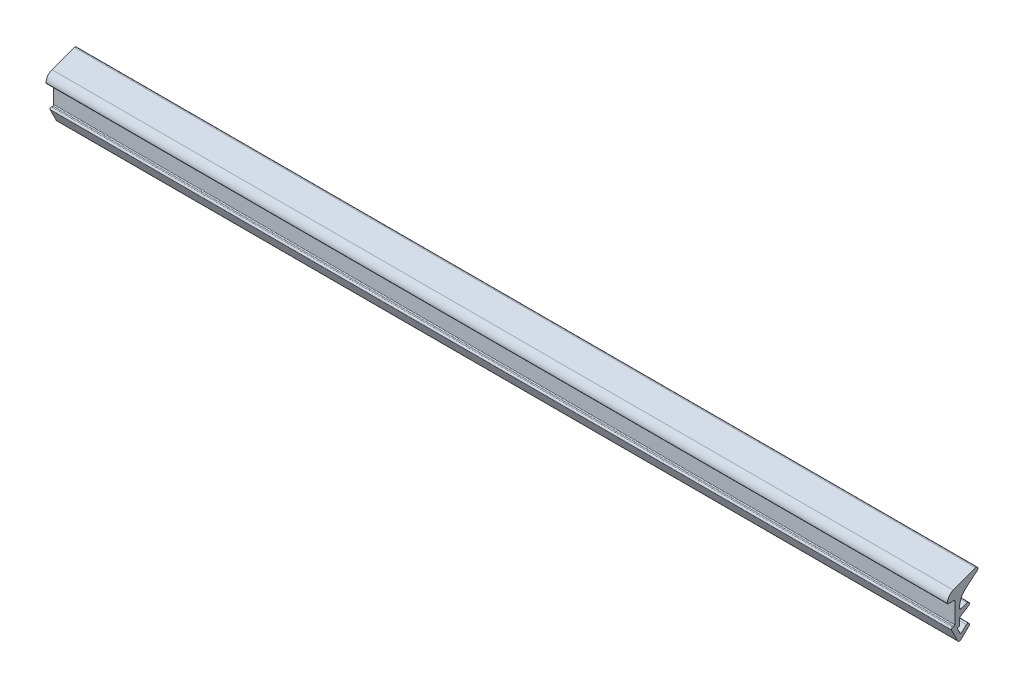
ISO-10303-21;
HEADER;
FILE_DESCRIPTION(('STEP AP214'),'2;1');
FILE_NAME('part.step','',(''),(''),'','','');
FILE_SCHEMA(('AUTOMOTIVE_DESIGN { 1 0 10303 214 1 1 1 1 }'));
ENDSEC;
DATA;
#1=APPLICATION_CONTEXT('core data for automotive mechanical design processes');
#2=APPLICATION_PROTOCOL_DEFINITION('international standard','automotive_design',2000,#1);
#3=PRODUCT_CONTEXT('',#1,'mechanical');
#4=PRODUCT('Part','Part','',(#3));
#5=PRODUCT_RELATED_PRODUCT_CATEGORY('part','',(#4));
#6=PRODUCT_DEFINITION_FORMATION('','',#4);
#7=PRODUCT_DEFINITION_CONTEXT('part definition',#1,'design');
#8=PRODUCT_DEFINITION('design','',#6,#7);
#9=PRODUCT_DEFINITION_SHAPE('','',#8);
#10=(LENGTH_UNIT() NAMED_UNIT(*) SI_UNIT(.MILLI.,.METRE.));
#11=(NAMED_UNIT(*) PLANE_ANGLE_UNIT() SI_UNIT($,.RADIAN.));
#12=(NAMED_UNIT(*) SI_UNIT($,.STERADIAN.) SOLID_ANGLE_UNIT());
#13=UNCERTAINTY_MEASURE_WITH_UNIT(LENGTH_MEASURE(1.E-05),#10,'distance_accuracy_value','');
#14=(GEOMETRIC_REPRESENTATION_CONTEXT(3) GLOBAL_UNCERTAINTY_ASSIGNED_CONTEXT((#13)) GLOBAL_UNIT_ASSIGNED_CONTEXT((#10,
#11,#12)) REPRESENTATION_CONTEXT('',''));
#15=CARTESIAN_POINT('',(0.,0.,0.));
#16=DIRECTION('',(0.,0.,1.));
#17=DIRECTION('',(1.,0.,0.));
#18=AXIS2_PLACEMENT_3D('',#15,#16,#17);
#19=CARTESIAN_POINT('',(200.,0.69634473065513,-4.15955987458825));
#20=DIRECTION('',(-1.,0.,0.));
#21=DIRECTION('',(0.,0.,1.));
#22=AXIS2_PLACEMENT_3D('',#19,#20,#21);
#23=CYLINDRICAL_SURFACE('',#22,3.99999999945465);
#24=CARTESIAN_POINT('',(0.,0.69634473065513,-4.15955987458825));
#25=DIRECTION('',(-1.,0.,0.));
#26=DIRECTION('',(0.,0.,-1.));
#27=AXIS2_PLACEMENT_3D('',#24,#25,#26);
#28=CIRCLE('',#27,3.99999999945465);
#29=CARTESIAN_POINT('',(0.,0.69634473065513,-0.159559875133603));
#30=VERTEX_POINT('',#29);
#31=CARTESIAN_POINT('',(0.,3.76052250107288,-1.58840943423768));
#32=VERTEX_POINT('',#31);
#33=EDGE_CURVE('E363',#30,#32,#28,.T.);
#34=ORIENTED_EDGE('',*,*,#33,.T.);
#35=DIRECTION('',(-1.,0.,0.));
#36=VECTOR('',#35,1.);
#37=CARTESIAN_POINT('',(200.,3.76052250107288,-1.58840943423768));
#38=LINE('',#37,#36);
#39=CARTESIAN_POINT('',(200.,3.76052250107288,-1.58840943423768));
#40=VERTEX_POINT('',#39);
#41=EDGE_CURVE('E12',#40,#32,#38,.T.);
#42=ORIENTED_EDGE('',*,*,#41,.F.);
#43=CARTESIAN_POINT('',(200.,0.69634473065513,-4.15955987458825));
#44=DIRECTION('',(-1.,0.,0.));
#45=DIRECTION('',(0.,0.,-1.));
#46=AXIS2_PLACEMENT_3D('',#43,#44,#45);
#47=CIRCLE('',#46,3.99999999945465);
#48=CARTESIAN_POINT('',(200.,0.69634473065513,-0.159559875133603));
#49=VERTEX_POINT('',#48);
#50=EDGE_CURVE('E448',#49,#40,#47,.T.);
#51=ORIENTED_EDGE('',*,*,#50,.F.);
#52=DIRECTION('',(-1.,0.,0.));
#53=VECTOR('',#52,1.);
#54=CARTESIAN_POINT('',(200.,0.69634473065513,-0.159559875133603));
#55=LINE('',#54,#53);
#56=EDGE_CURVE('E359',#49,#30,#55,.T.);
#57=ORIENTED_EDGE('',*,*,#56,.T.);
#58=EDGE_LOOP('',(#34,#42,#51,#57));
#59=FACE_BOUND('',#58,.T.);
#60=ADVANCED_FACE('F136',(#59),#23,.F.);
#61=CARTESIAN_POINT('',(200.,3.76052250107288,-1.58840943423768));
#62=DIRECTION('',(0.,0.766044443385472,0.642787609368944));
#63=DIRECTION('',(0.,-0.642787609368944,0.766044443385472));
#64=AXIS2_PLACEMENT_3D('',#61,#62,#63);
#65=PLANE('',#64);
#66=DIRECTION('',(0.,0.642787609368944,-0.766044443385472));
#67=VECTOR('',#66,1.);
#68=CARTESIAN_POINT('',(0.,3.76052250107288,-1.58840943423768));
#69=LINE('',#68,#67);
#70=CARTESIAN_POINT('',(0.,5.8819891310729,-4.11667491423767));
#71=VERTEX_POINT('',#70);
#72=EDGE_CURVE('E367',#32,#71,#69,.T.);
#73=ORIENTED_EDGE('',*,*,#72,.T.);
#74=DIRECTION('',(-1.,0.,0.));
#75=VECTOR('',#74,1.);
#76=CARTESIAN_POINT('',(200.,5.8819891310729,-4.11667491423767));
#77=LINE('',#76,#75);
#78=CARTESIAN_POINT('',(200.,5.8819891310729,-4.11667491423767));
#79=VERTEX_POINT('',#78);
#80=EDGE_CURVE('E145',#79,#71,#77,.T.);
#81=ORIENTED_EDGE('',*,*,#80,.F.);
#82=DIRECTION('',(0.,0.642787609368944,-0.766044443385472));
#83=VECTOR('',#82,1.);
#84=CARTESIAN_POINT('',(200.,3.76052250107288,-1.58840943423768));
#85=LINE('',#84,#83);
#86=EDGE_CURVE('E259',#40,#79,#85,.T.);
#87=ORIENTED_EDGE('',*,*,#86,.F.);
#88=ORIENTED_EDGE('',*,*,#41,.T.);
#89=EDGE_LOOP('',(#73,#81,#87,#88));
#90=FACE_BOUND('',#89,.T.);
#91=ADVANCED_FACE('F661',(#90),#65,.F.);
#92=CARTESIAN_POINT('',(200.,6.18840691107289,-3.85955987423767));
#93=DIRECTION('',(-1.,0.,0.));
#94=DIRECTION('',(0.,0.,1.));
#95=AXIS2_PLACEMENT_3D('',#92,#93,#94);
#96=CYLINDRICAL_SURFACE('',#95,0.399999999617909);
#97=CARTESIAN_POINT('',(0.,6.18840691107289,-3.85955987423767));
#98=DIRECTION('',(1.,0.,0.));
#99=DIRECTION('',(0.,0.,-1.));
#100=AXIS2_PLACEMENT_3D('',#97,#98,#99);
#101=CIRCLE('',#100,0.399999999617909);
#102=CARTESIAN_POINT('',(0.,6.56428395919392,-3.72275181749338));
#103=VERTEX_POINT('',#102);
#104=EDGE_CURVE('E370',#71,#103,#101,.T.);
#105=ORIENTED_EDGE('',*,*,#104,.T.);
#106=DIRECTION('',(-1.,0.,0.));
#107=VECTOR('',#106,1.);
#108=CARTESIAN_POINT('',(200.,6.56428395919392,-3.72275181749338));
#109=LINE('',#108,#107);
#110=CARTESIAN_POINT('',(200.,6.56428395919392,-3.72275181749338));
#111=VERTEX_POINT('',#110);
#112=EDGE_CURVE('E543',#111,#103,#109,.T.);
#113=ORIENTED_EDGE('',*,*,#112,.F.);
#114=CARTESIAN_POINT('',(200.,6.18840691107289,-3.85955987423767));
#115=DIRECTION('',(1.,0.,0.));
#116=DIRECTION('',(0.,0.,-1.));
#117=AXIS2_PLACEMENT_3D('',#114,#115,#116);
#118=CIRCLE('',#117,0.399999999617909);
#119=EDGE_CURVE('E553',#79,#111,#118,.T.);
#120=ORIENTED_EDGE('',*,*,#119,.F.);
#121=ORIENTED_EDGE('',*,*,#80,.T.);
#122=EDGE_LOOP('',(#105,#113,#120,#121));
#123=FACE_BOUND('',#122,.T.);
#124=ADVANCED_FACE('F551',(#123),#96,.T.);
#125=CARTESIAN_POINT('',(200.,6.56428395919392,-3.72275181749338));
#126=DIRECTION('',(0.,-0.93969262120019,-0.342020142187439));
#127=DIRECTION('',(0.,0.342020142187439,-0.93969262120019));
#128=AXIS2_PLACEMENT_3D('',#125,#126,#127);
#129=PLANE('',#128);
#130=DIRECTION('',(0.,-0.342020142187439,0.93969262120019));
#131=VECTOR('',#130,1.);
#132=CARTESIAN_POINT('',(0.,6.56428395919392,-3.72275181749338));
#133=LINE('',#132,#131);
#134=CARTESIAN_POINT('',(0.,4.76363869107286,1.22448041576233));
#135=VERTEX_POINT('',#134);
#136=EDGE_CURVE('E373',#103,#135,#133,.T.);
#137=ORIENTED_EDGE('',*,*,#136,.T.);
#138=DIRECTION('',(-1.,0.,0.));
#139=VECTOR('',#138,1.);
#140=CARTESIAN_POINT('',(200.,4.76363869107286,1.22448041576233));
#141=LINE('',#140,#139);
#142=CARTESIAN_POINT('',(200.,4.76363869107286,1.22448041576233));
#143=VERTEX_POINT('',#142);
#144=EDGE_CURVE('E539',#143,#135,#141,.T.);
#145=ORIENTED_EDGE('',*,*,#144,.F.);
#146=DIRECTION('',(0.,-0.342020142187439,0.93969262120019));
#147=VECTOR('',#146,1.);
#148=CARTESIAN_POINT('',(200.,6.56428395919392,-3.72275181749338));
#149=LINE('',#148,#147);
#150=EDGE_CURVE('E572',#111,#143,#149,.T.);
#151=ORIENTED_EDGE('',*,*,#150,.F.);
#152=ORIENTED_EDGE('',*,*,#112,.T.);
#153=EDGE_LOOP('',(#137,#145,#151,#152));
#154=FACE_BOUND('',#153,.T.);
#155=ADVANCED_FACE('F562',(#154),#129,.F.);
#156=CARTESIAN_POINT('',(200.,2.88425345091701,0.540440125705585));
#157=DIRECTION('',(-1.,0.,0.));
#158=DIRECTION('',(0.,0.,1.));
#159=AXIS2_PLACEMENT_3D('',#156,#157,#158);
#160=CYLINDRICAL_SURFACE('',#159,1.99999999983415);
#161=CARTESIAN_POINT('',(0.,2.88425345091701,0.540440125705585));
#162=DIRECTION('',(1.,0.,0.));
#163=DIRECTION('',(0.,0.,-1.));
#164=AXIS2_PLACEMENT_3D('',#161,#162,#163);
#165=CIRCLE('',#164,1.99999999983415);
#166=CARTESIAN_POINT('',(0.,2.88425345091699,2.54044012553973));
#167=VERTEX_POINT('',#166);
#168=EDGE_CURVE('E376',#135,#167,#165,.T.);
#169=ORIENTED_EDGE('',*,*,#168,.T.);
#170=DIRECTION('',(-1.,0.,0.));
#171=VECTOR('',#170,1.);
#172=CARTESIAN_POINT('',(200.,2.88425345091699,2.54044012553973));
#173=LINE('',#172,#171);
#174=CARTESIAN_POINT('',(200.,2.88425345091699,2.54044012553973));
#175=VERTEX_POINT('',#174);
#176=EDGE_CURVE('E535',#175,#167,#173,.T.);
#177=ORIENTED_EDGE('',*,*,#176,.F.);
#178=CARTESIAN_POINT('',(200.,2.88425345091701,0.540440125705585));
#179=DIRECTION('',(1.,0.,0.));
#180=DIRECTION('',(0.,0.,-1.));
#181=AXIS2_PLACEMENT_3D('',#178,#179,#180);
#182=CIRCLE('',#181,1.99999999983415);
#183=EDGE_CURVE('E568',#143,#175,#182,.T.);
#184=ORIENTED_EDGE('',*,*,#183,.F.);
#185=ORIENTED_EDGE('',*,*,#144,.T.);
#186=EDGE_LOOP('',(#169,#177,#184,#185));
#187=FACE_BOUND('',#186,.T.);
#188=ADVANCED_FACE('F566',(#187),#160,.T.);
#189=CARTESIAN_POINT('',(200.,2.88425344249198,2.34459359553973));
#190=DIRECTION('',(-1.,0.,0.));
#191=DIRECTION('',(0.,0.,1.));
#192=AXIS2_PLACEMENT_3D('',#189,#190,#191);
#193=CYLINDRICAL_SURFACE('',#192,0.195846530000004);
#194=CARTESIAN_POINT('',(0.,2.88425344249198,2.34459359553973));
#195=DIRECTION('',(1.,0.,0.));
#196=DIRECTION('',(0.,0.,-1.));
#197=AXIS2_PLACEMENT_3D('',#194,#195,#196);
#198=CIRCLE('',#197,0.195846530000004);
#199=CARTESIAN_POINT('',(0.,2.68840691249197,2.34459359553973));
#200=VERTEX_POINT('',#199);
#201=EDGE_CURVE('E379',#167,#200,#198,.T.);
#202=ORIENTED_EDGE('',*,*,#201,.T.);
#203=DIRECTION('',(-1.,0.,0.));
#204=VECTOR('',#203,1.);
#205=CARTESIAN_POINT('',(200.,2.68840691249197,2.34459359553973));
#206=LINE('',#205,#204);
#207=CARTESIAN_POINT('',(200.,2.68840691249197,2.34459359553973));
#208=VERTEX_POINT('',#207);
#209=EDGE_CURVE('E531',#208,#200,#206,.T.);
#210=ORIENTED_EDGE('',*,*,#209,.F.);
#211=CARTESIAN_POINT('',(200.,2.88425344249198,2.34459359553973));
#212=DIRECTION('',(1.,0.,0.));
#213=DIRECTION('',(0.,0.,-1.));
#214=AXIS2_PLACEMENT_3D('',#211,#212,#213);
#215=CIRCLE('',#214,0.195846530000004);
#216=EDGE_CURVE('E571',#175,#208,#215,.T.);
#217=ORIENTED_EDGE('',*,*,#216,.F.);
#218=ORIENTED_EDGE('',*,*,#176,.T.);
#219=EDGE_LOOP('',(#202,#210,#217,#218));
#220=FACE_BOUND('',#219,.T.);
#221=ADVANCED_FACE('F674',(#220),#193,.T.);
#222=CARTESIAN_POINT('',(200.,2.68840691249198,2.34459359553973));
#223=DIRECTION('',(0.,1.,0.));
#224=DIRECTION('',(0.,0.,1.));
#225=AXIS2_PLACEMENT_3D('',#222,#223,#224);
#226=PLANE('',#225);
#227=DIRECTION('',(0.,0.,-1.));
#228=VECTOR('',#227,1.);
#229=CARTESIAN_POINT('',(0.,2.68840691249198,2.34459359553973));
#230=LINE('',#229,#228);
#231=CARTESIAN_POINT('',(0.,2.68840691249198,1.04044013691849));
#232=VERTEX_POINT('',#231);
#233=EDGE_CURVE('E382',#200,#232,#230,.T.);
#234=ORIENTED_EDGE('',*,*,#233,.T.);
#235=DIRECTION('',(-1.,0.,0.));
#236=VECTOR('',#235,1.);
#237=CARTESIAN_POINT('',(200.,2.68840691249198,1.04044013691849));
#238=LINE('',#237,#236);
#239=CARTESIAN_POINT('',(200.,2.68840691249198,1.04044013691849));
#240=VERTEX_POINT('',#239);
#241=EDGE_CURVE('E527',#240,#232,#238,.T.);
#242=ORIENTED_EDGE('',*,*,#241,.F.);
#243=DIRECTION('',(0.,0.,-1.));
#244=VECTOR('',#243,1.);
#245=CARTESIAN_POINT('',(200.,2.68840691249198,2.34459359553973));
#246=LINE('',#245,#244);
#247=EDGE_CURVE('E576',#208,#240,#246,.T.);
#248=ORIENTED_EDGE('',*,*,#247,.F.);
#249=ORIENTED_EDGE('',*,*,#209,.T.);
#250=EDGE_LOOP('',(#234,#242,#248,#249));
#251=FACE_BOUND('',#250,.T.);
#252=ADVANCED_FACE('F677',(#251),#226,.F.);
#253=CARTESIAN_POINT('',(200.,2.48840691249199,1.04044013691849));
#254=DIRECTION('',(-1.,0.,0.));
#255=DIRECTION('',(0.,0.,1.));
#256=AXIS2_PLACEMENT_3D('',#253,#254,#255);
#257=CYLINDRICAL_SURFACE('',#256,0.199999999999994);
#258=CARTESIAN_POINT('',(0.,2.48840691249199,1.04044013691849));
#259=DIRECTION('',(-1.,0.,0.));
#260=DIRECTION('',(0.,0.,-1.));
#261=AXIS2_PLACEMENT_3D('',#258,#259,#260);
#262=CIRCLE('',#261,0.199999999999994);
#263=CARTESIAN_POINT('',(0.,2.48840691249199,0.840440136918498));
#264=VERTEX_POINT('',#263);
#265=EDGE_CURVE('E385',#232,#264,#262,.T.);
#266=ORIENTED_EDGE('',*,*,#265,.T.);
#267=DIRECTION('',(-1.,0.,0.));
#268=VECTOR('',#267,1.);
#269=CARTESIAN_POINT('',(200.,2.48840691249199,0.840440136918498));
#270=LINE('',#269,#268);
#271=CARTESIAN_POINT('',(200.,2.48840691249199,0.840440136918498));
#272=VERTEX_POINT('',#271);
#273=EDGE_CURVE('E523',#272,#264,#270,.T.);
#274=ORIENTED_EDGE('',*,*,#273,.F.);
#275=CARTESIAN_POINT('',(200.,2.48840691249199,1.04044013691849));
#276=DIRECTION('',(-1.,0.,0.));
#277=DIRECTION('',(0.,0.,-1.));
#278=AXIS2_PLACEMENT_3D('',#275,#276,#277);
#279=CIRCLE('',#278,0.199999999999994);
#280=EDGE_CURVE('E583',#240,#272,#279,.T.);
#281=ORIENTED_EDGE('',*,*,#280,.F.);
#282=ORIENTED_EDGE('',*,*,#241,.T.);
#283=EDGE_LOOP('',(#266,#274,#281,#282));
#284=FACE_BOUND('',#283,.T.);
#285=ADVANCED_FACE('F681',(#284),#257,.F.);
#286=CARTESIAN_POINT('',(200.,2.48840691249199,0.84044013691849));
#287=DIRECTION('',(0.,0.,-1.));
#288=DIRECTION('',(-1.,0.,0.));
#289=AXIS2_PLACEMENT_3D('',#286,#287,#288);
#290=PLANE('',#289);
#291=DIRECTION('',(0.,-1.,0.));
#292=VECTOR('',#291,1.);
#293=CARTESIAN_POINT('',(0.,2.48840691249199,0.84044013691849));
#294=LINE('',#293,#292);
#295=CARTESIAN_POINT('',(0.,-2.11159308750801,0.84044013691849));
#296=VERTEX_POINT('',#295);
#297=EDGE_CURVE('E388',#264,#296,#294,.T.);
#298=ORIENTED_EDGE('',*,*,#297,.T.);
#299=DIRECTION('',(-1.,0.,0.));
#300=VECTOR('',#299,1.);
#301=CARTESIAN_POINT('',(200.,-2.11159308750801,0.84044013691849));
#302=LINE('',#301,#300);
#303=CARTESIAN_POINT('',(200.,-2.11159308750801,0.84044013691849));
#304=VERTEX_POINT('',#303);
#305=EDGE_CURVE('E519',#304,#296,#302,.T.);
#306=ORIENTED_EDGE('',*,*,#305,.F.);
#307=DIRECTION('',(0.,-1.,0.));
#308=VECTOR('',#307,1.);
#309=CARTESIAN_POINT('',(200.,2.48840691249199,0.84044013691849));
#310=LINE('',#309,#308);
#311=EDGE_CURVE('E586',#272,#304,#310,.T.);
#312=ORIENTED_EDGE('',*,*,#311,.F.);
#313=ORIENTED_EDGE('',*,*,#273,.T.);
#314=EDGE_LOOP('',(#298,#306,#312,#313));
#315=FACE_BOUND('',#314,.T.);
#316=ADVANCED_FACE('F685',(#315),#290,.F.);
#317=CARTESIAN_POINT('',(200.,-2.11159308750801,1.04044013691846));
#318=DIRECTION('',(-1.,0.,0.));
#319=DIRECTION('',(0.,0.,1.));
#320=AXIS2_PLACEMENT_3D('',#317,#318,#319);
#321=CYLINDRICAL_SURFACE('',#320,0.199999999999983);
#322=CARTESIAN_POINT('',(0.,-2.11159308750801,1.04044013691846));
#323=DIRECTION('',(-1.,0.,0.));
#324=DIRECTION('',(0.,0.,-1.));
#325=AXIS2_PLACEMENT_3D('',#322,#323,#324);
#326=CIRCLE('',#325,0.199999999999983);
#327=CARTESIAN_POINT('',(0.,-2.311593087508,1.04044013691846));
#328=VERTEX_POINT('',#327);
#329=EDGE_CURVE('E391',#296,#328,#326,.T.);
#330=ORIENTED_EDGE('',*,*,#329,.T.);
#331=DIRECTION('',(-1.,0.,0.));
#332=VECTOR('',#331,1.);
#333=CARTESIAN_POINT('',(200.,-2.311593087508,1.04044013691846));
#334=LINE('',#333,#332);
#335=CARTESIAN_POINT('',(200.,-2.311593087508,1.04044013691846));
#336=VERTEX_POINT('',#335);
#337=EDGE_CURVE('E515',#336,#328,#334,.T.);
#338=ORIENTED_EDGE('',*,*,#337,.F.);
#339=CARTESIAN_POINT('',(200.,-2.11159308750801,1.04044013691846));
#340=DIRECTION('',(-1.,0.,0.));
#341=DIRECTION('',(0.,0.,-1.));
#342=AXIS2_PLACEMENT_3D('',#339,#340,#341);
#343=CIRCLE('',#342,0.199999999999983);
#344=EDGE_CURVE('E589',#304,#336,#343,.T.);
#345=ORIENTED_EDGE('',*,*,#344,.F.);
#346=ORIENTED_EDGE('',*,*,#305,.T.);
#347=EDGE_LOOP('',(#330,#338,#345,#346));
#348=FACE_BOUND('',#347,.T.);
#349=ADVANCED_FACE('F689',(#348),#321,.F.);
#350=CARTESIAN_POINT('',(200.,-2.31159308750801,1.04044013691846));
#351=DIRECTION('',(0.,-1.,0.));
#352=DIRECTION('',(0.,0.,-1.));
#353=AXIS2_PLACEMENT_3D('',#350,#351,#352);
#354=PLANE('',#353);
#355=DIRECTION('',(0.,0.,1.));
#356=VECTOR('',#355,1.);
#357=CARTESIAN_POINT('',(0.,-2.31159308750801,1.04044013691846));
#358=LINE('',#357,#356);
#359=CARTESIAN_POINT('',(0.,-2.31159308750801,1.34044013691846));
#360=VERTEX_POINT('',#359);
#361=EDGE_CURVE('E394',#328,#360,#358,.T.);
#362=ORIENTED_EDGE('',*,*,#361,.T.);
#363=DIRECTION('',(-1.,0.,0.));
#364=VECTOR('',#363,1.);
#365=CARTESIAN_POINT('',(200.,-2.31159308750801,1.34044013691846));
#366=LINE('',#365,#364);
#367=CARTESIAN_POINT('',(200.,-2.31159308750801,1.34044013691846));
#368=VERTEX_POINT('',#367);
#369=EDGE_CURVE('E511',#368,#360,#366,.T.);
#370=ORIENTED_EDGE('',*,*,#369,.F.);
#371=DIRECTION('',(0.,0.,1.));
#372=VECTOR('',#371,1.);
#373=CARTESIAN_POINT('',(200.,-2.31159308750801,1.04044013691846));
#374=LINE('',#373,#372);
#375=EDGE_CURVE('E592',#336,#368,#374,.T.);
#376=ORIENTED_EDGE('',*,*,#375,.F.);
#377=ORIENTED_EDGE('',*,*,#337,.T.);
#378=EDGE_LOOP('',(#362,#370,#376,#377));
#379=FACE_BOUND('',#378,.T.);
#380=ADVANCED_FACE('F693',(#379),#354,.F.);
#381=CARTESIAN_POINT('',(200.,-2.61159308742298,1.34044013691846));
#382=DIRECTION('',(-1.,0.,0.));
#383=DIRECTION('',(0.,0.,1.));
#384=AXIS2_PLACEMENT_3D('',#381,#382,#383);
#385=CYLINDRICAL_SURFACE('',#384,0.299999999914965);
#386=CARTESIAN_POINT('',(0.,-2.61159308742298,1.34044013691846));
#387=DIRECTION('',(1.,0.,0.));
#388=DIRECTION('',(0.,0.,-1.));
#389=AXIS2_PLACEMENT_3D('',#386,#387,#388);
#390=CIRCLE('',#389,0.299999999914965);
#391=CARTESIAN_POINT('',(0.,-2.74386257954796,1.60970725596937));
#392=VERTEX_POINT('',#391);
#393=EDGE_CURVE('E397',#360,#392,#390,.T.);
#394=ORIENTED_EDGE('',*,*,#393,.T.);
#395=DIRECTION('',(-1.,0.,0.));
#396=VECTOR('',#395,1.);
#397=CARTESIAN_POINT('',(200.,-2.74386257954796,1.60970725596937));
#398=LINE('',#397,#396);
#399=CARTESIAN_POINT('',(200.,-2.74386257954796,1.60970725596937));
#400=VERTEX_POINT('',#399);
#401=EDGE_CURVE('E507',#400,#392,#398,.T.);
#402=ORIENTED_EDGE('',*,*,#401,.F.);
#403=CARTESIAN_POINT('',(200.,-2.61159308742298,1.34044013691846));
#404=DIRECTION('',(1.,0.,0.));
#405=DIRECTION('',(0.,0.,-1.));
#406=AXIS2_PLACEMENT_3D('',#403,#404,#405);
#407=CIRCLE('',#406,0.299999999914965);
#408=EDGE_CURVE('E595',#368,#400,#407,.T.);
#409=ORIENTED_EDGE('',*,*,#408,.F.);
#410=ORIENTED_EDGE('',*,*,#369,.T.);
#411=EDGE_LOOP('',(#394,#402,#409,#410));
#412=FACE_BOUND('',#411,.T.);
#413=ADVANCED_FACE('F697',(#412),#385,.T.);
#414=CARTESIAN_POINT('',(200.,-2.74386257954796,1.60970725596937));
#415=DIRECTION('',(0.,0.440898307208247,-0.897557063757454));
#416=DIRECTION('',(0.,0.897557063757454,0.440898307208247));
#417=AXIS2_PLACEMENT_3D('',#414,#415,#416);
#418=PLANE('',#417);
#419=DIRECTION('',(0.,-0.897557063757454,-0.440898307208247));
#420=VECTOR('',#419,1.);
#421=CARTESIAN_POINT('',(0.,-2.74386257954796,1.60970725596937));
#422=LINE('',#421,#420);
#423=CARTESIAN_POINT('',(0.,-5.43204223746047,0.289218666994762));
#424=VERTEX_POINT('',#423);
#425=EDGE_CURVE('E400',#392,#424,#422,.T.);
#426=ORIENTED_EDGE('',*,*,#425,.T.);
#427=DIRECTION('',(-1.,0.,0.));
#428=VECTOR('',#427,1.);
#429=CARTESIAN_POINT('',(200.,-5.43204223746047,0.289218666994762));
#430=LINE('',#429,#428);
#431=CARTESIAN_POINT('',(200.,-5.43204223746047,0.289218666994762));
#432=VERTEX_POINT('',#431);
#433=EDGE_CURVE('E503',#432,#424,#430,.T.);
#434=ORIENTED_EDGE('',*,*,#433,.F.);
#435=DIRECTION('',(0.,-0.897557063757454,-0.440898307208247));
#436=VECTOR('',#435,1.);
#437=CARTESIAN_POINT('',(200.,-2.74386257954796,1.60970725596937));
#438=LINE('',#437,#436);
#439=EDGE_CURVE('E598',#400,#432,#438,.T.);
#440=ORIENTED_EDGE('',*,*,#439,.F.);
#441=ORIENTED_EDGE('',*,*,#401,.T.);
#442=EDGE_LOOP('',(#426,#434,#440,#441));
#443=FACE_BOUND('',#442,.T.);
#444=ADVANCED_FACE('F701',(#443),#418,.F.);
#445=CARTESIAN_POINT('',(200.,-5.21159308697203,-0.159559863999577));
#446=DIRECTION('',(-1.,0.,0.));
#447=DIRECTION('',(0.,0.,1.));
#448=AXIS2_PLACEMENT_3D('',#445,#446,#447);
#449=CYLINDRICAL_SURFACE('',#448,0.499999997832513);
#450=CARTESIAN_POINT('',(0.,-5.21159308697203,-0.159559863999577));
#451=DIRECTION('',(1.,0.,0.));
#452=DIRECTION('',(0.,0.,-1.));
#453=AXIS2_PLACEMENT_3D('',#450,#451,#452);
#454=CIRCLE('',#453,0.499999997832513);
#455=CARTESIAN_POINT('',(0.,-5.57118234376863,-0.506972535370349));
#456=VERTEX_POINT('',#455);
#457=EDGE_CURVE('E403',#424,#456,#454,.T.);
#458=ORIENTED_EDGE('',*,*,#457,.T.);
#459=DIRECTION('',(-1.,0.,0.));
#460=VECTOR('',#459,1.);
#461=CARTESIAN_POINT('',(200.,-5.57118234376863,-0.506972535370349));
#462=LINE('',#461,#460);
#463=CARTESIAN_POINT('',(200.,-5.57118234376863,-0.506972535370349));
#464=VERTEX_POINT('',#463);
#465=EDGE_CURVE('E499',#464,#456,#462,.T.);
#466=ORIENTED_EDGE('',*,*,#465,.F.);
#467=CARTESIAN_POINT('',(200.,-5.21159308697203,-0.159559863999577));
#468=DIRECTION('',(1.,0.,0.));
#469=DIRECTION('',(0.,0.,-1.));
#470=AXIS2_PLACEMENT_3D('',#467,#468,#469);
#471=CIRCLE('',#470,0.499999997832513);
#472=EDGE_CURVE('E601',#432,#464,#471,.T.);
#473=ORIENTED_EDGE('',*,*,#472,.F.);
#474=ORIENTED_EDGE('',*,*,#433,.T.);
#475=EDGE_LOOP('',(#458,#466,#473,#474));
#476=FACE_BOUND('',#475,.T.);
#477=ADVANCED_FACE('F705',(#476),#449,.T.);
#478=CARTESIAN_POINT('',(200.,-5.57118234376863,-0.50697253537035));
#479=DIRECTION('',(0.,0.719178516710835,0.694825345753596));
#480=DIRECTION('',(0.,-0.694825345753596,0.719178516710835));
#481=AXIS2_PLACEMENT_3D('',#478,#479,#480);
#482=PLANE('',#481);
#483=DIRECTION('',(0.,0.694825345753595,-0.719178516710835));
#484=VECTOR('',#483,1.);
#485=CARTESIAN_POINT('',(0.,-5.57118234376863,-0.50697253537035));
#486=LINE('',#485,#484);
#487=CARTESIAN_POINT('',(0.,-3.89926448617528,-2.23749001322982));
#488=VERTEX_POINT('',#487);
#489=EDGE_CURVE('E406',#456,#488,#486,.T.);
#490=ORIENTED_EDGE('',*,*,#489,.T.);
#491=DIRECTION('',(-1.,0.,0.));
#492=VECTOR('',#491,1.);
#493=CARTESIAN_POINT('',(200.,-3.89926448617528,-2.23749001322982));
#494=LINE('',#493,#492);
#495=CARTESIAN_POINT('',(200.,-3.89926448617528,-2.23749001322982));
#496=VERTEX_POINT('',#495);
#497=EDGE_CURVE('E495',#496,#488,#494,.T.);
#498=ORIENTED_EDGE('',*,*,#497,.F.);
#499=DIRECTION('',(0.,0.694825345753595,-0.719178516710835));
#500=VECTOR('',#499,1.);
#501=CARTESIAN_POINT('',(200.,-5.57118234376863,-0.50697253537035));
#502=LINE('',#501,#500);
#503=EDGE_CURVE('E604',#464,#496,#502,.T.);
#504=ORIENTED_EDGE('',*,*,#503,.F.);
#505=ORIENTED_EDGE('',*,*,#465,.T.);
#506=EDGE_LOOP('',(#490,#498,#504,#505));
#507=FACE_BOUND('',#506,.T.);
#508=ADVANCED_FACE('F709',(#507),#482,.F.);
#509=CARTESIAN_POINT('',(200.,-3.61159307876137,-1.95955987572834));
#510=DIRECTION('',(-1.,0.,0.));
#511=DIRECTION('',(0.,0.,1.));
#512=AXIS2_PLACEMENT_3D('',#509,#510,#511);
#513=CYLINDRICAL_SURFACE('',#512,0.399999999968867);
#514=CARTESIAN_POINT('',(0.,-3.61159307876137,-1.95955987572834));
#515=DIRECTION('',(1.,0.,0.));
#516=DIRECTION('',(0.,0.,-1.));
#517=AXIS2_PLACEMENT_3D('',#514,#515,#516);
#518=CIRCLE('',#517,0.399999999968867);
#519=CARTESIAN_POINT('',(0.,-3.32392167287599,-1.68162973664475));
#520=VERTEX_POINT('',#519);
#521=EDGE_CURVE('E409',#488,#520,#518,.T.);
#522=ORIENTED_EDGE('',*,*,#521,.T.);
#523=DIRECTION('',(-1.,0.,0.));
#524=VECTOR('',#523,1.);
#525=CARTESIAN_POINT('',(200.,-3.32392167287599,-1.68162973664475));
#526=LINE('',#525,#524);
#527=CARTESIAN_POINT('',(200.,-3.32392167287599,-1.68162973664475));
#528=VERTEX_POINT('',#527);
#529=EDGE_CURVE('E491',#528,#520,#526,.T.);
#530=ORIENTED_EDGE('',*,*,#529,.F.);
#531=CARTESIAN_POINT('',(200.,-3.61159307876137,-1.95955987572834));
#532=DIRECTION('',(1.,0.,0.));
#533=DIRECTION('',(0.,0.,-1.));
#534=AXIS2_PLACEMENT_3D('',#531,#532,#533);
#535=CIRCLE('',#534,0.399999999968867);
#536=EDGE_CURVE('E607',#496,#528,#535,.T.);
#537=ORIENTED_EDGE('',*,*,#536,.F.);
#538=ORIENTED_EDGE('',*,*,#497,.T.);
#539=EDGE_LOOP('',(#522,#530,#537,#538));
#540=FACE_BOUND('',#539,.T.);
#541=ADVANCED_FACE('F713',(#540),#513,.T.);
#542=CARTESIAN_POINT('',(200.,-3.32392167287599,-1.68162973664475));
#543=DIRECTION('',(0.,-0.719178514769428,-0.694825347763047));
#544=DIRECTION('',(0.,0.694825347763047,-0.719178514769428));
#545=AXIS2_PLACEMENT_3D('',#542,#543,#544);
#546=PLANE('',#545);
#547=DIRECTION('',(0.,-0.694825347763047,0.719178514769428));
#548=VECTOR('',#547,1.);
#549=CARTESIAN_POINT('',(0.,-3.32392167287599,-1.68162973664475));
#550=LINE('',#549,#548);
#551=CARTESIAN_POINT('',(0.,-4.37296808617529,-0.595814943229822));
#552=VERTEX_POINT('',#551);
#553=EDGE_CURVE('E412',#520,#552,#550,.T.);
#554=ORIENTED_EDGE('',*,*,#553,.T.);
#555=DIRECTION('',(-1.,0.,0.));
#556=VECTOR('',#555,1.);
#557=CARTESIAN_POINT('',(200.,-4.37296808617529,-0.595814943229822));
#558=LINE('',#557,#556);
#559=CARTESIAN_POINT('',(200.,-4.37296808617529,-0.595814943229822));
#560=VERTEX_POINT('',#559);
#561=EDGE_CURVE('E487',#560,#552,#558,.T.);
#562=ORIENTED_EDGE('',*,*,#561,.F.);
#563=DIRECTION('',(0.,-0.694825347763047,0.719178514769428));
#564=VECTOR('',#563,1.);
#565=CARTESIAN_POINT('',(200.,-3.32392167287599,-1.68162973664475));
#566=LINE('',#565,#564);
#567=EDGE_CURVE('E610',#528,#560,#566,.T.);
#568=ORIENTED_EDGE('',*,*,#567,.F.);
#569=ORIENTED_EDGE('',*,*,#529,.T.);
#570=EDGE_LOOP('',(#554,#562,#568,#569));
#571=FACE_BOUND('',#570,.T.);
#572=ADVANCED_FACE('F717',(#571),#546,.F.);
#573=CARTESIAN_POINT('',(200.,-4.22913238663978,-0.456849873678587));
#574=DIRECTION('',(-1.,0.,0.));
#575=DIRECTION('',(0.,0.,1.));
#576=AXIS2_PLACEMENT_3D('',#573,#574,#575);
#577=CYLINDRICAL_SURFACE('',#576,0.199999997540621);
#578=CARTESIAN_POINT('',(0.,-4.22913238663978,-0.456849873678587));
#579=DIRECTION('',(-1.,0.,0.));
#580=DIRECTION('',(0.,0.,-1.));
#581=AXIS2_PLACEMENT_3D('',#578,#579,#580);
#582=CIRCLE('',#581,0.199999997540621);
#583=CARTESIAN_POINT('',(0.,-4.31731204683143,-0.277338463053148));
#584=VERTEX_POINT('',#583);
#585=EDGE_CURVE('E415',#552,#584,#582,.T.);
#586=ORIENTED_EDGE('',*,*,#585,.T.);
#587=DIRECTION('',(-1.,0.,0.));
#588=VECTOR('',#587,1.);
#589=CARTESIAN_POINT('',(200.,-4.31731204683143,-0.277338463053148));
#590=LINE('',#589,#588);
#591=CARTESIAN_POINT('',(200.,-4.31731204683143,-0.277338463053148));
#592=VERTEX_POINT('',#591);
#593=EDGE_CURVE('E483',#592,#584,#590,.T.);
#594=ORIENTED_EDGE('',*,*,#593,.F.);
#595=CARTESIAN_POINT('',(200.,-4.22913238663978,-0.456849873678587));
#596=DIRECTION('',(-1.,0.,0.));
#597=DIRECTION('',(0.,0.,-1.));
#598=AXIS2_PLACEMENT_3D('',#595,#596,#597);
#599=CIRCLE('',#598,0.199999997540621);
#600=EDGE_CURVE('E613',#560,#592,#599,.T.);
#601=ORIENTED_EDGE('',*,*,#600,.F.);
#602=ORIENTED_EDGE('',*,*,#561,.T.);
#603=EDGE_LOOP('',(#586,#594,#601,#602));
#604=FACE_BOUND('',#603,.T.);
#605=ADVANCED_FACE('F721',(#604),#577,.F.);
#606=CARTESIAN_POINT('',(200.,-4.31731204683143,-0.277338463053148));
#607=DIRECTION('',(0.,-0.440898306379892,0.897557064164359));
#608=DIRECTION('',(0.,-0.897557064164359,-0.440898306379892));
#609=AXIS2_PLACEMENT_3D('',#606,#607,#608);
#610=PLANE('',#609);
#611=DIRECTION('',(0.,0.897557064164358,0.440898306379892));
#612=VECTOR('',#611,1.);
#613=CARTESIAN_POINT('',(0.,-4.31731204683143,-0.277338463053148));
#614=LINE('',#613,#612);
#615=CARTESIAN_POINT('',(0.,-3.19977274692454,0.27161959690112));
#616=VERTEX_POINT('',#615);
#617=EDGE_CURVE('E418',#584,#616,#614,.T.);
#618=ORIENTED_EDGE('',*,*,#617,.T.);
#619=DIRECTION('',(-1.,0.,0.));
#620=VECTOR('',#619,1.);
#621=CARTESIAN_POINT('',(200.,-3.19977274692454,0.27161959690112));
#622=LINE('',#621,#620);
#623=CARTESIAN_POINT('',(200.,-3.19977274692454,0.27161959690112));
#624=VERTEX_POINT('',#623);
#625=EDGE_CURVE('E479',#624,#616,#622,.T.);
#626=ORIENTED_EDGE('',*,*,#625,.F.);
#627=DIRECTION('',(0.,0.897557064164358,0.440898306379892));
#628=VECTOR('',#627,1.);
#629=CARTESIAN_POINT('',(200.,-4.31731204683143,-0.277338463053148));
#630=LINE('',#629,#628);
#631=EDGE_CURVE('E616',#592,#624,#630,.T.);
#632=ORIENTED_EDGE('',*,*,#631,.F.);
#633=ORIENTED_EDGE('',*,*,#593,.T.);
#634=EDGE_LOOP('',(#618,#626,#632,#633));
#635=FACE_BOUND('',#634,.T.);
#636=ADVANCED_FACE('F725',(#635),#610,.F.);
#637=CARTESIAN_POINT('',(200.,-3.11159308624,0.0921081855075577));
#638=DIRECTION('',(-1.,0.,0.));
#639=DIRECTION('',(0.,0.,1.));
#640=AXIS2_PLACEMENT_3D('',#637,#638,#639);
#641=CYLINDRICAL_SURFACE('',#640,0.199999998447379);
#642=CARTESIAN_POINT('',(0.,-3.11159308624,0.0921081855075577));
#643=DIRECTION('',(-1.,0.,0.));
#644=DIRECTION('',(0.,0.,-1.));
#645=AXIS2_PLACEMENT_3D('',#642,#643,#644);
#646=CIRCLE('',#645,0.199999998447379);
#647=CARTESIAN_POINT('',(0.,-2.91159308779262,0.0921081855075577));
#648=VERTEX_POINT('',#647);
#649=EDGE_CURVE('E421',#616,#648,#646,.T.);
#650=ORIENTED_EDGE('',*,*,#649,.T.);
#651=DIRECTION('',(-1.,0.,0.));
#652=VECTOR('',#651,1.);
#653=CARTESIAN_POINT('',(200.,-2.91159308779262,0.0921081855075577));
#654=LINE('',#653,#652);
#655=CARTESIAN_POINT('',(200.,-2.91159308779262,0.0921081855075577));
#656=VERTEX_POINT('',#655);
#657=EDGE_CURVE('E475',#656,#648,#654,.T.);
#658=ORIENTED_EDGE('',*,*,#657,.F.);
#659=CARTESIAN_POINT('',(200.,-3.11159308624,0.0921081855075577));
#660=DIRECTION('',(-1.,0.,0.));
#661=DIRECTION('',(0.,0.,-1.));
#662=AXIS2_PLACEMENT_3D('',#659,#660,#661);
#663=CIRCLE('',#662,0.199999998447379);
#664=EDGE_CURVE('E619',#624,#656,#663,.T.);
#665=ORIENTED_EDGE('',*,*,#664,.F.);
#666=ORIENTED_EDGE('',*,*,#625,.T.);
#667=EDGE_LOOP('',(#650,#658,#665,#666));
#668=FACE_BOUND('',#667,.T.);
#669=ADVANCED_FACE('F729',(#668),#641,.F.);
#670=CARTESIAN_POINT('',(200.,-2.91159308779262,0.0921081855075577));
#671=DIRECTION('',(0.,1.,0.));
#672=DIRECTION('',(0.,0.,1.));
#673=AXIS2_PLACEMENT_3D('',#670,#671,#672);
#674=PLANE('',#673);
#675=DIRECTION('',(0.,0.,-1.));
#676=VECTOR('',#675,1.);
#677=CARTESIAN_POINT('',(0.,-2.91159308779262,0.0921081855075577));
#678=LINE('',#677,#676);
#679=CARTESIAN_POINT('',(0.,-2.91159308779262,0.0904401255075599));
#680=VERTEX_POINT('',#679);
#681=EDGE_CURVE('E424',#648,#680,#678,.T.);
#682=ORIENTED_EDGE('',*,*,#681,.T.);
#683=DIRECTION('',(-1.,0.,0.));
#684=VECTOR('',#683,1.);
#685=CARTESIAN_POINT('',(200.,-2.91159308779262,0.0904401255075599));
#686=LINE('',#685,#684);
#687=CARTESIAN_POINT('',(200.,-2.91159308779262,0.0904401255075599));
#688=VERTEX_POINT('',#687);
#689=EDGE_CURVE('E471',#688,#680,#686,.T.);
#690=ORIENTED_EDGE('',*,*,#689,.F.);
#691=DIRECTION('',(0.,0.,-1.));
#692=VECTOR('',#691,1.);
#693=CARTESIAN_POINT('',(200.,-2.91159308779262,0.0921081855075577));
#694=LINE('',#693,#692);
#695=EDGE_CURVE('E622',#656,#688,#694,.T.);
#696=ORIENTED_EDGE('',*,*,#695,.F.);
#697=ORIENTED_EDGE('',*,*,#657,.T.);
#698=EDGE_LOOP('',(#682,#690,#696,#697));
#699=FACE_BOUND('',#698,.T.);
#700=ADVANCED_FACE('F733',(#699),#674,.F.);
#701=CARTESIAN_POINT('',(200.,-2.66159308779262,0.0904401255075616));
#702=DIRECTION('',(-1.,0.,0.));
#703=DIRECTION('',(0.,0.,1.));
#704=AXIS2_PLACEMENT_3D('',#701,#702,#703);
#705=CYLINDRICAL_SURFACE('',#704,0.25);
#706=CARTESIAN_POINT('',(0.,-2.66159308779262,0.0904401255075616));
#707=DIRECTION('',(1.,0.,0.));
#708=DIRECTION('',(0.,0.,-1.));
#709=AXIS2_PLACEMENT_3D('',#706,#707,#708);
#710=CIRCLE('',#709,0.25);
#711=CARTESIAN_POINT('',(0.,-2.66159308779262,-0.159559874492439));
#712=VERTEX_POINT('',#711);
#713=EDGE_CURVE('E427',#680,#712,#710,.T.);
#714=ORIENTED_EDGE('',*,*,#713,.T.);
#715=DIRECTION('',(-1.,0.,0.));
#716=VECTOR('',#715,1.);
#717=CARTESIAN_POINT('',(200.,-2.66159308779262,-0.159559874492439));
#718=LINE('',#717,#716);
#719=CARTESIAN_POINT('',(200.,-2.66159308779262,-0.159559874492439));
#720=VERTEX_POINT('',#719);
#721=EDGE_CURVE('E467',#720,#712,#718,.T.);
#722=ORIENTED_EDGE('',*,*,#721,.F.);
#723=CARTESIAN_POINT('',(200.,-2.66159308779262,0.0904401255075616));
#724=DIRECTION('',(1.,0.,0.));
#725=DIRECTION('',(0.,0.,-1.));
#726=AXIS2_PLACEMENT_3D('',#723,#724,#725);
#727=CIRCLE('',#726,0.25);
#728=EDGE_CURVE('E625',#688,#720,#727,.T.);
#729=ORIENTED_EDGE('',*,*,#728,.F.);
#730=ORIENTED_EDGE('',*,*,#689,.T.);
#731=EDGE_LOOP('',(#714,#722,#729,#730));
#732=FACE_BOUND('',#731,.T.);
#733=ADVANCED_FACE('F737',(#732),#705,.T.);
#734=CARTESIAN_POINT('',(200.,-2.66159308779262,-0.159559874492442));
#735=DIRECTION('',(0.,0.,1.));
#736=DIRECTION('',(1.,0.,0.));
#737=AXIS2_PLACEMENT_3D('',#734,#735,#736);
#738=PLANE('',#737);
#739=DIRECTION('',(0.,1.,0.));
#740=VECTOR('',#739,1.);
#741=CARTESIAN_POINT('',(0.,-2.66159308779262,-0.159559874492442));
#742=LINE('',#741,#740);
#743=CARTESIAN_POINT('',(0.,-1.37432199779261,-0.159559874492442));
#744=VERTEX_POINT('',#743);
#745=EDGE_CURVE('E430',#712,#744,#742,.T.);
#746=ORIENTED_EDGE('',*,*,#745,.T.);
#747=DIRECTION('',(-1.,0.,0.));
#748=VECTOR('',#747,1.);
#749=CARTESIAN_POINT('',(200.,-1.37432199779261,-0.159559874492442));
#750=LINE('',#749,#748);
#751=CARTESIAN_POINT('',(200.,-1.37432199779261,-0.159559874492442));
#752=VERTEX_POINT('',#751);
#753=EDGE_CURVE('E463',#752,#744,#750,.T.);
#754=ORIENTED_EDGE('',*,*,#753,.F.);
#755=DIRECTION('',(0.,1.,0.));
#756=VECTOR('',#755,1.);
#757=CARTESIAN_POINT('',(200.,-2.66159308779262,-0.159559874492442));
#758=LINE('',#757,#756);
#759=EDGE_CURVE('E628',#720,#752,#758,.T.);
#760=ORIENTED_EDGE('',*,*,#759,.F.);
#761=ORIENTED_EDGE('',*,*,#721,.T.);
#762=EDGE_LOOP('',(#746,#754,#760,#761));
#763=FACE_BOUND('',#762,.T.);
#764=ADVANCED_FACE('F741',(#763),#738,.F.);
#765=CARTESIAN_POINT('',(200.,-1.37432199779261,-0.459559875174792));
#766=DIRECTION('',(-1.,0.,0.));
#767=DIRECTION('',(0.,0.,1.));
#768=AXIS2_PLACEMENT_3D('',#765,#766,#767);
#769=CYLINDRICAL_SURFACE('',#768,0.300000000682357);
#770=CARTESIAN_POINT('',(0.,-1.37432199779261,-0.459559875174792));
#771=DIRECTION('',(-1.,0.,0.));
#772=DIRECTION('',(0.,0.,-1.));
#773=AXIS2_PLACEMENT_3D('',#770,#771,#772);
#774=CIRCLE('',#773,0.300000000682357);
#775=CARTESIAN_POINT('',(0.,-1.11990756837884,-0.300584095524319));
#776=VERTEX_POINT('',#775);
#777=EDGE_CURVE('E433',#744,#776,#774,.T.);
#778=ORIENTED_EDGE('',*,*,#777,.T.);
#779=DIRECTION('',(-1.,0.,0.));
#780=VECTOR('',#779,1.);
#781=CARTESIAN_POINT('',(200.,-1.11990756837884,-0.300584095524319));
#782=LINE('',#781,#780);
#783=CARTESIAN_POINT('',(200.,-1.11990756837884,-0.300584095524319));
#784=VERTEX_POINT('',#783);
#785=EDGE_CURVE('E459',#784,#776,#782,.T.);
#786=ORIENTED_EDGE('',*,*,#785,.F.);
#787=CARTESIAN_POINT('',(200.,-1.37432199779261,-0.459559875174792));
#788=DIRECTION('',(-1.,0.,0.));
#789=DIRECTION('',(0.,0.,-1.));
#790=AXIS2_PLACEMENT_3D('',#787,#788,#789);
#791=CIRCLE('',#790,0.300000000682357);
#792=EDGE_CURVE('E631',#752,#784,#791,.T.);
#793=ORIENTED_EDGE('',*,*,#792,.F.);
#794=ORIENTED_EDGE('',*,*,#753,.T.);
#795=EDGE_LOOP('',(#778,#786,#793,#794));
#796=FACE_BOUND('',#795,.T.);
#797=ADVANCED_FACE('F745',(#796),#769,.F.);
#798=CARTESIAN_POINT('',(200.,-1.11990756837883,-0.300584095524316));
#799=DIRECTION('',(0.,0.848048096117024,0.529919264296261));
#800=DIRECTION('',(0.,-0.529919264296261,0.848048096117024));
#801=AXIS2_PLACEMENT_3D('',#798,#799,#800);
#802=PLANE('',#801);
#803=DIRECTION('',(0.,0.529919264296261,-0.848048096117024));
#804=VECTOR('',#803,1.);
#805=CARTESIAN_POINT('',(0.,-1.11990756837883,-0.300584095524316));
#806=LINE('',#805,#804);
#807=CARTESIAN_POINT('',(0.,0.0491876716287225,-2.17152757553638));
#808=VERTEX_POINT('',#807);
#809=EDGE_CURVE('E436',#776,#808,#806,.T.);
#810=ORIENTED_EDGE('',*,*,#809,.T.);
#811=DIRECTION('',(-1.,0.,0.));
#812=VECTOR('',#811,1.);
#813=CARTESIAN_POINT('',(200.,0.0491876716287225,-2.17152757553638));
#814=LINE('',#813,#812);
#815=CARTESIAN_POINT('',(200.,0.0491876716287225,-2.17152757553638));
#816=VERTEX_POINT('',#815);
#817=EDGE_CURVE('E455',#816,#808,#814,.T.);
#818=ORIENTED_EDGE('',*,*,#817,.F.);
#819=DIRECTION('',(0.,0.529919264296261,-0.848048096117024));
#820=VECTOR('',#819,1.);
#821=CARTESIAN_POINT('',(200.,-1.11990756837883,-0.300584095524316));
#822=LINE('',#821,#820);
#823=EDGE_CURVE('E634',#784,#816,#822,.T.);
#824=ORIENTED_EDGE('',*,*,#823,.F.);
#825=ORIENTED_EDGE('',*,*,#785,.T.);
#826=EDGE_LOOP('',(#810,#818,#824,#825));
#827=FACE_BOUND('',#826,.T.);
#828=ADVANCED_FACE('F642',(#827),#802,.F.);
#829=CARTESIAN_POINT('',(200.,0.388406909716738,-1.95955986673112));
#830=DIRECTION('',(-1.,0.,0.));
#831=DIRECTION('',(0.,0.,1.));
#832=AXIS2_PLACEMENT_3D('',#829,#830,#831);
#833=CYLINDRICAL_SURFACE('',#832,0.400000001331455);
#834=CARTESIAN_POINT('',(0.,0.388406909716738,-1.95955986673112));
#835=DIRECTION('',(1.,0.,0.));
#836=DIRECTION('',(0.,0.,-1.));
#837=AXIS2_PLACEMENT_3D('',#834,#835,#836);
#838=CIRCLE('',#837,0.400000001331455);
#839=CARTESIAN_POINT('',(0.,0.764283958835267,-1.82275180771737));
#840=VERTEX_POINT('',#839);
#841=EDGE_CURVE('E439',#808,#840,#838,.T.);
#842=ORIENTED_EDGE('',*,*,#841,.T.);
#843=DIRECTION('',(-1.,0.,0.));
#844=VECTOR('',#843,1.);
#845=CARTESIAN_POINT('',(200.,0.764283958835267,-1.82275180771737));
#846=LINE('',#845,#844);
#847=CARTESIAN_POINT('',(200.,0.764283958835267,-1.82275180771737));
#848=VERTEX_POINT('',#847);
#849=EDGE_CURVE('E352',#848,#840,#846,.T.);
#850=ORIENTED_EDGE('',*,*,#849,.F.);
#851=CARTESIAN_POINT('',(200.,0.388406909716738,-1.95955986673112));
#852=DIRECTION('',(1.,0.,0.));
#853=DIRECTION('',(0.,0.,-1.));
#854=AXIS2_PLACEMENT_3D('',#851,#852,#853);
#855=CIRCLE('',#854,0.400000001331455);
#856=EDGE_CURVE('E341',#816,#848,#855,.T.);
#857=ORIENTED_EDGE('',*,*,#856,.F.);
#858=ORIENTED_EDGE('',*,*,#817,.T.);
#859=EDGE_LOOP('',(#842,#850,#857,#858));
#860=FACE_BOUND('',#859,.T.);
#861=ADVANCED_FACE('F646',(#860),#833,.T.);
#862=CARTESIAN_POINT('',(200.,0.764283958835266,-1.82275180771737));
#863=DIRECTION('',(0.,-0.939692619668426,-0.342020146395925));
#864=DIRECTION('',(0.,0.342020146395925,-0.939692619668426));
#865=AXIS2_PLACEMENT_3D('',#862,#863,#864);
#866=PLANE('',#865);
#867=DIRECTION('',(0.,-0.342020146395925,0.939692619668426));
#868=VECTOR('',#867,1.);
#869=CARTESIAN_POINT('',(0.,0.764283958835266,-1.82275180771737));
#870=LINE('',#869,#868);
#871=CARTESIAN_POINT('',(0.,0.305468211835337,-0.562165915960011));
#872=VERTEX_POINT('',#871);
#873=EDGE_CURVE('E350',#840,#872,#870,.T.);
#874=ORIENTED_EDGE('',*,*,#873,.T.);
#875=DIRECTION('',(-1.,0.,0.));
#876=VECTOR('',#875,1.);
#877=CARTESIAN_POINT('',(200.,0.305468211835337,-0.562165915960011));
#878=LINE('',#877,#876);
#879=CARTESIAN_POINT('',(200.,0.305468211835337,-0.562165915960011));
#880=VERTEX_POINT('',#879);
#881=EDGE_CURVE('E347',#880,#872,#878,.T.);
#882=ORIENTED_EDGE('',*,*,#881,.F.);
#883=DIRECTION('',(0.,-0.342020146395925,0.939692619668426));
#884=VECTOR('',#883,1.);
#885=CARTESIAN_POINT('',(200.,0.764283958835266,-1.82275180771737));
#886=LINE('',#885,#884);
#887=EDGE_CURVE('E335',#848,#880,#886,.T.);
#888=ORIENTED_EDGE('',*,*,#887,.F.);
#889=ORIENTED_EDGE('',*,*,#849,.T.);
#890=EDGE_LOOP('',(#874,#882,#888,#889));
#891=FACE_BOUND('',#890,.T.);
#892=ADVANCED_FACE('F348',(#891),#866,.F.);
#893=CARTESIAN_POINT('',(200.,0.587376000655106,-0.459559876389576));
#894=DIRECTION('',(-1.,0.,0.));
#895=DIRECTION('',(0.,0.,1.));
#896=AXIS2_PLACEMENT_3D('',#893,#894,#895);
#897=CYLINDRICAL_SURFACE('',#896,0.300000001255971);
#898=CARTESIAN_POINT('',(0.,0.587376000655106,-0.459559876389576));
#899=DIRECTION('',(-1.,0.,0.));
#900=DIRECTION('',(0.,0.,-1.));
#901=AXIS2_PLACEMENT_3D('',#898,#899,#900);
#902=CIRCLE('',#901,0.300000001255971);
#903=CARTESIAN_POINT('',(0.,0.587376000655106,-0.159559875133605));
#904=VERTEX_POINT('',#903);
#905=EDGE_CURVE('E245',#872,#904,#902,.T.);
#906=ORIENTED_EDGE('',*,*,#905,.T.);
#907=DIRECTION('',(-1.,0.,0.));
#908=VECTOR('',#907,1.);
#909=CARTESIAN_POINT('',(200.,0.587376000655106,-0.159559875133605));
#910=LINE('',#909,#908);
#911=CARTESIAN_POINT('',(200.,0.587376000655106,-0.159559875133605));
#912=VERTEX_POINT('',#911);
#913=EDGE_CURVE('E353',#912,#904,#910,.T.);
#914=ORIENTED_EDGE('',*,*,#913,.F.);
#915=CARTESIAN_POINT('',(200.,0.587376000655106,-0.459559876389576));
#916=DIRECTION('',(-1.,0.,0.));
#917=DIRECTION('',(0.,0.,-1.));
#918=AXIS2_PLACEMENT_3D('',#915,#916,#917);
#919=CIRCLE('',#918,0.300000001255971);
#920=EDGE_CURVE('E339',#880,#912,#919,.T.);
#921=ORIENTED_EDGE('',*,*,#920,.F.);
#922=ORIENTED_EDGE('',*,*,#881,.T.);
#923=EDGE_LOOP('',(#906,#914,#921,#922));
#924=FACE_BOUND('',#923,.T.);
#925=ADVANCED_FACE('F355',(#924),#897,.F.);
#926=CARTESIAN_POINT('',(200.,0.587376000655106,-0.159559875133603));
#927=DIRECTION('',(0.,0.,1.));
#928=DIRECTION('',(1.,0.,0.));
#929=AXIS2_PLACEMENT_3D('',#926,#927,#928);
#930=PLANE('',#929);
#931=DIRECTION('',(0.,1.,0.));
#932=VECTOR('',#931,1.);
#933=CARTESIAN_POINT('',(0.,0.587376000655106,-0.159559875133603));
#934=LINE('',#933,#932);
#935=EDGE_CURVE('E251',#904,#30,#934,.T.);
#936=ORIENTED_EDGE('',*,*,#935,.T.);
#937=ORIENTED_EDGE('',*,*,#56,.F.);
#938=DIRECTION('',(0.,1.,0.));
#939=VECTOR('',#938,1.);
#940=CARTESIAN_POINT('',(200.,0.587376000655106,-0.159559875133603));
#941=LINE('',#940,#939);
#942=EDGE_CURVE('E153',#912,#49,#941,.T.);
#943=ORIENTED_EDGE('',*,*,#942,.F.);
#944=ORIENTED_EDGE('',*,*,#913,.T.);
#945=EDGE_LOOP('',(#936,#937,#943,#944));
#946=FACE_BOUND('',#945,.T.);
#947=ADVANCED_FACE('F650',(#946),#930,.F.);
#948=CARTESIAN_POINT('',(200.,0.69634473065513,-4.15955987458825));
#949=DIRECTION('',(1.,0.,0.));
#950=DIRECTION('',(0.,0.,-1.));
#951=AXIS2_PLACEMENT_3D('',#948,#949,#950);
#952=PLANE('',#951);
#953=ORIENTED_EDGE('',*,*,#50,.T.);
#954=ORIENTED_EDGE('',*,*,#86,.T.);
#955=ORIENTED_EDGE('',*,*,#119,.T.);
#956=ORIENTED_EDGE('',*,*,#150,.T.);
#957=ORIENTED_EDGE('',*,*,#183,.T.);
#958=ORIENTED_EDGE('',*,*,#216,.T.);
#959=ORIENTED_EDGE('',*,*,#247,.T.);
#960=ORIENTED_EDGE('',*,*,#280,.T.);
#961=ORIENTED_EDGE('',*,*,#311,.T.);
#962=ORIENTED_EDGE('',*,*,#344,.T.);
#963=ORIENTED_EDGE('',*,*,#375,.T.);
#964=ORIENTED_EDGE('',*,*,#408,.T.);
#965=ORIENTED_EDGE('',*,*,#439,.T.);
#966=ORIENTED_EDGE('',*,*,#472,.T.);
#967=ORIENTED_EDGE('',*,*,#503,.T.);
#968=ORIENTED_EDGE('',*,*,#536,.T.);
#969=ORIENTED_EDGE('',*,*,#567,.T.);
#970=ORIENTED_EDGE('',*,*,#600,.T.);
#971=ORIENTED_EDGE('',*,*,#631,.T.);
#972=ORIENTED_EDGE('',*,*,#664,.T.);
#973=ORIENTED_EDGE('',*,*,#695,.T.);
#974=ORIENTED_EDGE('',*,*,#728,.T.);
#975=ORIENTED_EDGE('',*,*,#759,.T.);
#976=ORIENTED_EDGE('',*,*,#792,.T.);
#977=ORIENTED_EDGE('',*,*,#823,.T.);
#978=ORIENTED_EDGE('',*,*,#856,.T.);
#979=ORIENTED_EDGE('',*,*,#887,.T.);
#980=ORIENTED_EDGE('',*,*,#920,.T.);
#981=ORIENTED_EDGE('',*,*,#942,.T.);
#982=EDGE_LOOP('',(#953,#954,#955,#956,#957,#958,#959,#960,#961,#962,#963,#964,#965,#966,#967,
#968,#969,#970,#971,#972,#973,#974,#975,#976,#977,#978,#979,#980,#981));
#983=FACE_BOUND('',#982,.T.);
#984=ADVANCED_FACE('F337',(#983),#952,.T.);
#985=CARTESIAN_POINT('',(0.,0.69634473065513,-4.15955987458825));
#986=DIRECTION('',(1.,0.,0.));
#987=DIRECTION('',(0.,0.,-1.));
#988=AXIS2_PLACEMENT_3D('',#985,#986,#987);
#989=PLANE('',#988);
#990=ORIENTED_EDGE('',*,*,#33,.F.);
#991=ORIENTED_EDGE('',*,*,#935,.F.);
#992=ORIENTED_EDGE('',*,*,#905,.F.);
#993=ORIENTED_EDGE('',*,*,#873,.F.);
#994=ORIENTED_EDGE('',*,*,#841,.F.);
#995=ORIENTED_EDGE('',*,*,#809,.F.);
#996=ORIENTED_EDGE('',*,*,#777,.F.);
#997=ORIENTED_EDGE('',*,*,#745,.F.);
#998=ORIENTED_EDGE('',*,*,#713,.F.);
#999=ORIENTED_EDGE('',*,*,#681,.F.);
#1000=ORIENTED_EDGE('',*,*,#649,.F.);
#1001=ORIENTED_EDGE('',*,*,#617,.F.);
#1002=ORIENTED_EDGE('',*,*,#585,.F.);
#1003=ORIENTED_EDGE('',*,*,#553,.F.);
#1004=ORIENTED_EDGE('',*,*,#521,.F.);
#1005=ORIENTED_EDGE('',*,*,#489,.F.);
#1006=ORIENTED_EDGE('',*,*,#457,.F.);
#1007=ORIENTED_EDGE('',*,*,#425,.F.);
#1008=ORIENTED_EDGE('',*,*,#393,.F.);
#1009=ORIENTED_EDGE('',*,*,#361,.F.);
#1010=ORIENTED_EDGE('',*,*,#329,.F.);
#1011=ORIENTED_EDGE('',*,*,#297,.F.);
#1012=ORIENTED_EDGE('',*,*,#265,.F.);
#1013=ORIENTED_EDGE('',*,*,#233,.F.);
#1014=ORIENTED_EDGE('',*,*,#201,.F.);
#1015=ORIENTED_EDGE('',*,*,#168,.F.);
#1016=ORIENTED_EDGE('',*,*,#136,.F.);
#1017=ORIENTED_EDGE('',*,*,#104,.F.);
#1018=ORIENTED_EDGE('',*,*,#72,.F.);
#1019=EDGE_LOOP('',(#990,#991,#992,#993,#994,#995,#996,#997,#998,#999,#1000,#1001,#1002,#1003,
#1004,#1005,#1006,#1007,#1008,#1009,#1010,#1011,#1012,#1013,#1014,#1015,#1016,#1017,#1018));
#1020=FACE_BOUND('',#1019,.T.);
#1021=ADVANCED_FACE('F557',(#1020),#989,.F.);
#1022=CLOSED_SHELL('',(#60,#91,#124,#155,#188,#221,#252,#285,#316,#349,#380,#413,#444,#477,#508,
#541,#572,#605,#636,#669,#700,#733,#764,#797,#828,#861,#892,#925,#947,#984,#1021));
#1023=MANIFOLD_SOLID_BREP('B2',#1022);
#1024=ADVANCED_BREP_SHAPE_REPRESENTATION('',(#18,#1023),#14);
#1025=SHAPE_DEFINITION_REPRESENTATION(#9,#1024);
ENDSEC;
END-ISO-10303-21;
